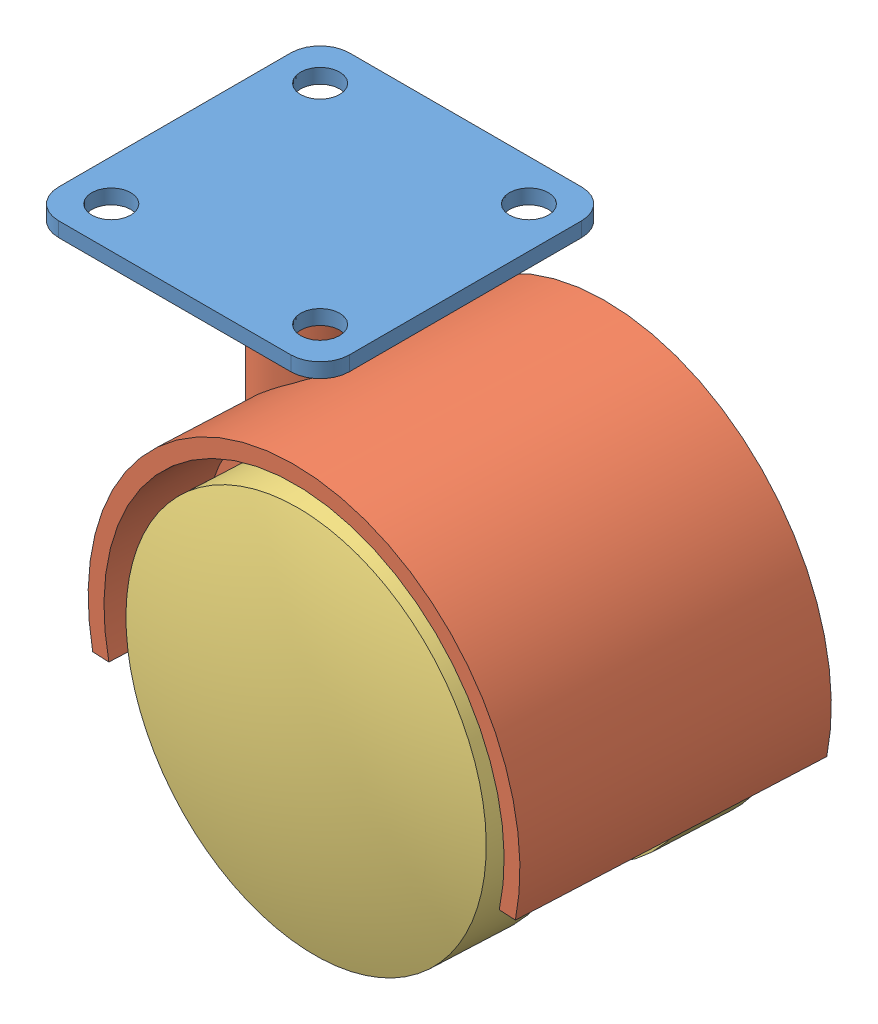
SolidWorks assembly caster wheel assembly.SLDASM, configuration Default (file format 9000). Lengths in mm.
Overall size (68.07 65.34 46.76).
4 component instances, 3 part files, 6 mates.
Components (placement in the parent):
- caster wheel metal-1: caster wheel metal.SLDPRT [Default] at (10.1406 20.1116 28.0607) size (37.85 8.38 37.85)
- caster wheel black-1: caster wheel black.SLDPRT [Default] at (27.9636 -12.2099 47.9757) x (0 -1 0) z (0.047283 0 -0.998882) size (38.35 59.06 38.73)
- caster wheel wheelet-1: caster wheel wheelet.SLDPRT [Default] at (29.2727 -12.2099 20.3206) x (0.047283 0 -0.998882) z (0.998882 0 0.047283) size (13.61 49.28 49.28)
- caster wheel wheelet-2: caster wheel wheelet.SLDPRT [Default] at (28.456 -12.2099 37.5733) x (-0.047283 0 0.998882) z (-0.998882 0 -0.047283) size (13.61 49.28 49.28)
Mates (geometry in assembly coordinates):
- Coincident1: coincident anti-aligned: plane of caster wheel metal-1 through (10.1406 20.1116 28.0607) normal (0 -1 0); plane of caster wheel black-1 through (10.1406 20.1116 28.0607) normal (0 1 0)
- Concentric1: concentric anti-aligned: cylinder of caster wheel metal-1 through (10.1406 21.8896 28.0607) axis (0 -1 0) radius 3.4925; cylinder of caster wheel black-1 through (10.1406 0.8076 28.0607) axis (0 1 0) radius 3.4925
- Distance1: distance = 1.651 mm anti-aligned: plane of caster wheel wheelet-1 through (29.2727 -12.2099 20.3206) normal (-0.047283 0 0.998882); plane of caster wheel black-1 through (29.1946 -12.2099 21.9698) normal (0.047283 0 -0.998882)
- Concentric2: concentric anti-aligned: cylinder of caster wheel black-1 through (29.7951 -12.2099 9.284) axis (-0.047283 0 0.998882) radius 27.3685; cylinder of caster wheel wheelet-1 through (29.916 -12.2099 6.7301) axis (0.047283 0 -0.998882) radius 24.638
- Distance2: distance = 1.651 mm anti-aligned: plane of caster wheel wheelet-2 through (28.456 -12.2099 37.5733) normal (0.047283 0 -0.998882); plane of caster wheel black-1 through (28.5341 -12.2099 35.9242) normal (-0.047283 0 0.998882)
- Concentric3: concentric aligned: cylinder of caster wheel black-1 through (29.7951 -12.2099 9.284) axis (-0.047283 0 0.998882) radius 27.3685; cylinder of caster wheel wheelet-2 through (27.8127 -12.2099 51.1639) axis (-0.047283 0 0.998882) radius 24.638
